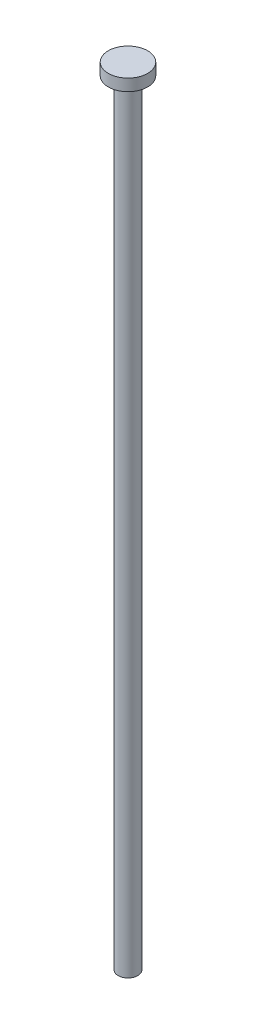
ISO-10303-21;
HEADER;
FILE_DESCRIPTION(('STEP AP214'),'2;1');
FILE_NAME('part.step','',(''),(''),'','','');
FILE_SCHEMA(('AUTOMOTIVE_DESIGN { 1 0 10303 214 1 1 1 1 }'));
ENDSEC;
DATA;
#1=APPLICATION_CONTEXT('core data for automotive mechanical design processes');
#2=APPLICATION_PROTOCOL_DEFINITION('international standard','automotive_design',2000,#1);
#3=PRODUCT_CONTEXT('',#1,'mechanical');
#4=PRODUCT('Part','Part','',(#3));
#5=PRODUCT_RELATED_PRODUCT_CATEGORY('part','',(#4));
#6=PRODUCT_DEFINITION_FORMATION('','',#4);
#7=PRODUCT_DEFINITION_CONTEXT('part definition',#1,'design');
#8=PRODUCT_DEFINITION('design','',#6,#7);
#9=PRODUCT_DEFINITION_SHAPE('','',#8);
#10=(LENGTH_UNIT() NAMED_UNIT(*) SI_UNIT(.MILLI.,.METRE.));
#11=(NAMED_UNIT(*) PLANE_ANGLE_UNIT() SI_UNIT($,.RADIAN.));
#12=(NAMED_UNIT(*) SI_UNIT($,.STERADIAN.) SOLID_ANGLE_UNIT());
#13=UNCERTAINTY_MEASURE_WITH_UNIT(LENGTH_MEASURE(1.E-05),#10,'distance_accuracy_value','');
#14=(GEOMETRIC_REPRESENTATION_CONTEXT(3) GLOBAL_UNCERTAINTY_ASSIGNED_CONTEXT((#13)) GLOBAL_UNIT_ASSIGNED_CONTEXT((#10,
#11,#12)) REPRESENTATION_CONTEXT('',''));
#15=CARTESIAN_POINT('',(0.,0.,0.));
#16=DIRECTION('',(0.,0.,1.));
#17=DIRECTION('',(1.,0.,0.));
#18=AXIS2_PLACEMENT_3D('',#15,#16,#17);
#19=CARTESIAN_POINT('',(0.,-200.,0.));
#20=DIRECTION('',(0.,1.,0.));
#21=DIRECTION('',(0.,0.,1.));
#22=AXIS2_PLACEMENT_3D('',#19,#20,#21);
#23=CYLINDRICAL_SURFACE('',#22,2.5);
#24=CARTESIAN_POINT('',(0.,-3.3,0.));
#25=DIRECTION('',(0.,1.,0.));
#26=DIRECTION('',(0.,0.,1.));
#27=AXIS2_PLACEMENT_3D('',#24,#25,#26);
#28=CIRCLE('',#27,2.5);
#29=CARTESIAN_POINT('',(0.,-3.3,2.5));
#30=VERTEX_POINT('',#29);
#31=EDGE_CURVE('E35',#30,#30,#28,.F.);
#32=ORIENTED_EDGE('',*,*,#31,.T.);
#33=EDGE_LOOP('',(#32));
#34=FACE_BOUND('',#33,.T.);
#35=CARTESIAN_POINT('',(0.,-200.,0.));
#36=DIRECTION('',(0.,1.,0.));
#37=DIRECTION('',(0.,0.,1.));
#38=AXIS2_PLACEMENT_3D('',#35,#36,#37);
#39=CIRCLE('',#38,2.5);
#40=CARTESIAN_POINT('',(0.,-200.,2.5));
#41=VERTEX_POINT('',#40);
#42=EDGE_CURVE('E39',#41,#41,#39,.T.);
#43=ORIENTED_EDGE('',*,*,#42,.T.);
#44=EDGE_LOOP('',(#43));
#45=FACE_BOUND('',#44,.T.);
#46=ADVANCED_FACE('F28',(#34,#45),#23,.T.);
#47=CARTESIAN_POINT('',(0.,-200.,0.));
#48=DIRECTION('',(0.,1.,0.));
#49=DIRECTION('',(0.,0.,1.));
#50=AXIS2_PLACEMENT_3D('',#47,#48,#49);
#51=PLANE('',#50);
#52=ORIENTED_EDGE('',*,*,#42,.F.);
#53=EDGE_LOOP('',(#52));
#54=FACE_BOUND('',#53,.T.);
#55=ADVANCED_FACE('F65',(#54),#51,.F.);
#56=CARTESIAN_POINT('',(0.,-3.,0.));
#57=DIRECTION('',(0.,1.,0.));
#58=DIRECTION('',(0.,0.,1.));
#59=AXIS2_PLACEMENT_3D('',#56,#57,#58);
#60=CYLINDRICAL_SURFACE('',#59,5.);
#61=CARTESIAN_POINT('',(0.,-3.,0.));
#62=DIRECTION('',(0.,1.,0.));
#63=DIRECTION('',(0.,0.,1.));
#64=AXIS2_PLACEMENT_3D('',#61,#62,#63);
#65=CIRCLE('',#64,5.);
#66=CARTESIAN_POINT('',(0.,-3.,5.));
#67=VERTEX_POINT('',#66);
#68=EDGE_CURVE('E43',#67,#67,#65,.T.);
#69=ORIENTED_EDGE('',*,*,#68,.T.);
#70=EDGE_LOOP('',(#69));
#71=FACE_BOUND('',#70,.T.);
#72=CARTESIAN_POINT('',(0.,0.,0.));
#73=DIRECTION('',(0.,1.,0.));
#74=DIRECTION('',(0.,0.,1.));
#75=AXIS2_PLACEMENT_3D('',#72,#73,#74);
#76=CIRCLE('',#75,5.);
#77=CARTESIAN_POINT('',(0.,0.,5.));
#78=VERTEX_POINT('',#77);
#79=EDGE_CURVE('E46',#78,#78,#76,.T.);
#80=ORIENTED_EDGE('',*,*,#79,.F.);
#81=EDGE_LOOP('',(#80));
#82=FACE_BOUND('',#81,.T.);
#83=ADVANCED_FACE('F52',(#71,#82),#60,.T.);
#84=CARTESIAN_POINT('',(0.,-3.,0.));
#85=DIRECTION('',(0.,1.,0.));
#86=DIRECTION('',(0.,0.,1.));
#87=AXIS2_PLACEMENT_3D('',#84,#85,#86);
#88=PLANE('',#87);
#89=CARTESIAN_POINT('',(0.,-3.,0.));
#90=DIRECTION('',(0.,1.,0.));
#91=DIRECTION('',(0.,0.,1.));
#92=AXIS2_PLACEMENT_3D('',#89,#90,#91);
#93=CIRCLE('',#92,2.8);
#94=CARTESIAN_POINT('',(0.,-3.,2.8));
#95=VERTEX_POINT('',#94);
#96=EDGE_CURVE('E10',#95,#95,#93,.T.);
#97=ORIENTED_EDGE('',*,*,#96,.T.);
#98=EDGE_LOOP('',(#97));
#99=FACE_BOUND('',#98,.T.);
#100=ORIENTED_EDGE('',*,*,#68,.F.);
#101=EDGE_LOOP('',(#100));
#102=FACE_BOUND('',#101,.T.);
#103=ADVANCED_FACE('F55',(#99,#102),#88,.F.);
#104=CARTESIAN_POINT('',(0.,0.,0.));
#105=DIRECTION('',(0.,1.,0.));
#106=DIRECTION('',(0.,0.,1.));
#107=AXIS2_PLACEMENT_3D('',#104,#105,#106);
#108=PLANE('',#107);
#109=ORIENTED_EDGE('',*,*,#79,.T.);
#110=EDGE_LOOP('',(#109));
#111=FACE_BOUND('',#110,.T.);
#112=ADVANCED_FACE('F57',(#111),#108,.T.);
#113=CARTESIAN_POINT('',(0.,-3.3,0.));
#114=DIRECTION('',(0.,1.,0.));
#115=DIRECTION('',(0.,0.,1.));
#116=AXIS2_PLACEMENT_3D('',#113,#114,#115);
#117=TOROIDAL_SURFACE('',#116,2.8,0.3);
#118=ORIENTED_EDGE('',*,*,#96,.F.);
#119=EDGE_LOOP('',(#118));
#120=FACE_BOUND('',#119,.T.);
#121=ORIENTED_EDGE('',*,*,#31,.F.);
#122=EDGE_LOOP('',(#121));
#123=FACE_BOUND('',#122,.T.);
#124=ADVANCED_FACE('F30',(#120,#123),#117,.F.);
#125=CLOSED_SHELL('',(#46,#55,#83,#103,#112,#124));
#126=MANIFOLD_SOLID_BREP('B2',#125);
#127=ADVANCED_BREP_SHAPE_REPRESENTATION('',(#18,#126),#14);
#128=SHAPE_DEFINITION_REPRESENTATION(#9,#127);
ENDSEC;
END-ISO-10303-21;
